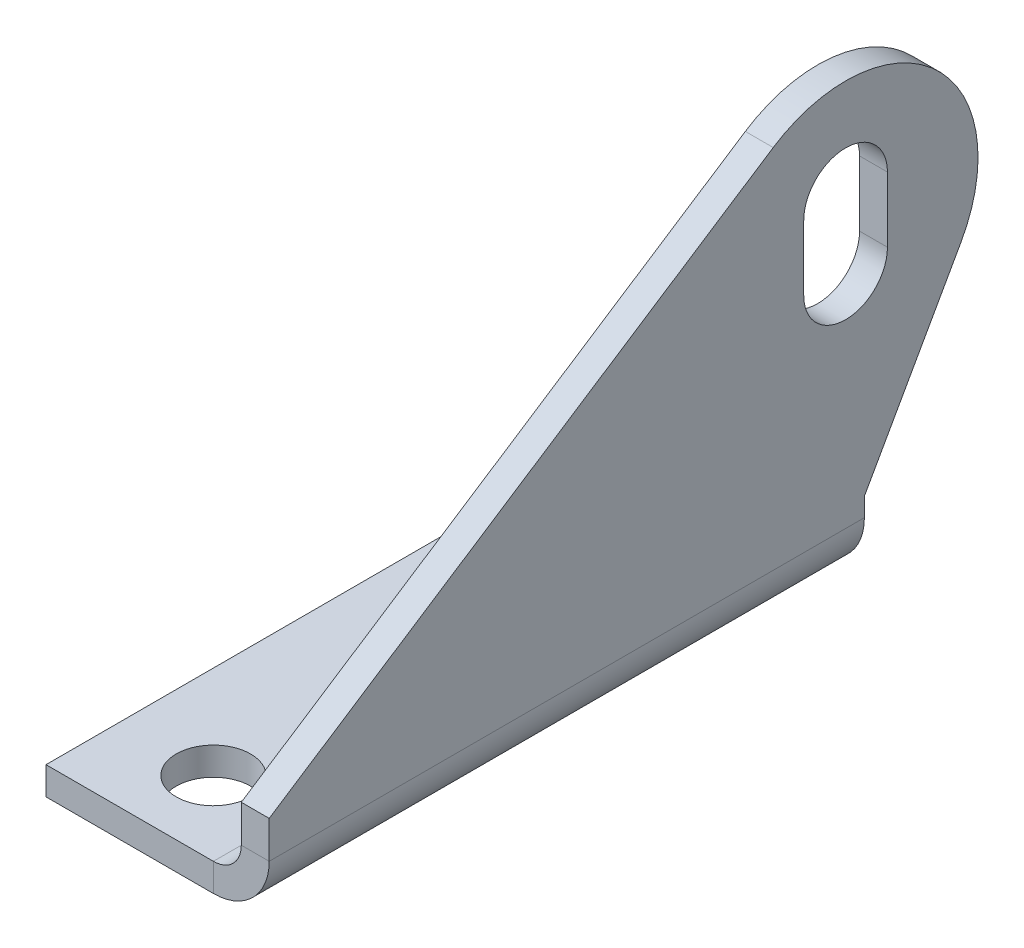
ISO-10303-21;
HEADER;
FILE_DESCRIPTION(('STEP AP214'),'2;1');
FILE_NAME('part.step','',(''),(''),'','','');
FILE_SCHEMA(('AUTOMOTIVE_DESIGN { 1 0 10303 214 1 1 1 1 }'));
ENDSEC;
DATA;
#1=APPLICATION_CONTEXT('core data for automotive mechanical design processes');
#2=APPLICATION_PROTOCOL_DEFINITION('international standard','automotive_design',2000,#1);
#3=PRODUCT_CONTEXT('',#1,'mechanical');
#4=PRODUCT('Part','Part','',(#3));
#5=PRODUCT_RELATED_PRODUCT_CATEGORY('part','',(#4));
#6=PRODUCT_DEFINITION_FORMATION('','',#4);
#7=PRODUCT_DEFINITION_CONTEXT('part definition',#1,'design');
#8=PRODUCT_DEFINITION('design','',#6,#7);
#9=PRODUCT_DEFINITION_SHAPE('','',#8);
#10=(LENGTH_UNIT() NAMED_UNIT(*) SI_UNIT(.MILLI.,.METRE.));
#11=(NAMED_UNIT(*) PLANE_ANGLE_UNIT() SI_UNIT($,.RADIAN.));
#12=(NAMED_UNIT(*) SI_UNIT($,.STERADIAN.) SOLID_ANGLE_UNIT());
#13=UNCERTAINTY_MEASURE_WITH_UNIT(LENGTH_MEASURE(1.E-05),#10,'distance_accuracy_value','');
#14=(GEOMETRIC_REPRESENTATION_CONTEXT(3) GLOBAL_UNCERTAINTY_ASSIGNED_CONTEXT((#13)) GLOBAL_UNIT_ASSIGNED_CONTEXT((#10,
#11,#12)) REPRESENTATION_CONTEXT('',''));
#15=CARTESIAN_POINT('',(0.,0.,0.));
#16=DIRECTION('',(0.,0.,1.));
#17=DIRECTION('',(1.,0.,0.));
#18=AXIS2_PLACEMENT_3D('',#15,#16,#17);
#19=CARTESIAN_POINT('',(-22.225,0.,-12.7));
#20=DIRECTION('',(0.,1.,0.));
#21=DIRECTION('',(-1.,0.,0.));
#22=AXIS2_PLACEMENT_3D('',#19,#20,#21);
#23=CYLINDRICAL_SURFACE('',#22,6.35);
#24=CARTESIAN_POINT('',(-22.225,0.,-12.7));
#25=DIRECTION('',(0.,1.,0.));
#26=DIRECTION('',(-1.,0.,0.));
#27=AXIS2_PLACEMENT_3D('',#24,#25,#26);
#28=CIRCLE('',#27,6.35);
#29=CARTESIAN_POINT('',(-28.575,0.,-12.7));
#30=VERTEX_POINT('',#29);
#31=EDGE_CURVE('E281',#30,#30,#28,.T.);
#32=ORIENTED_EDGE('',*,*,#31,.F.);
#33=EDGE_LOOP('',(#32));
#34=FACE_BOUND('',#33,.T.);
#35=CARTESIAN_POINT('',(-22.225,4.7625,-12.7));
#36=DIRECTION('',(0.,1.,0.));
#37=DIRECTION('',(-1.,0.,0.));
#38=AXIS2_PLACEMENT_3D('',#35,#36,#37);
#39=CIRCLE('',#38,6.35);
#40=CARTESIAN_POINT('',(-28.575,4.7625,-12.7));
#41=VERTEX_POINT('',#40);
#42=EDGE_CURVE('E172',#41,#41,#39,.T.);
#43=ORIENTED_EDGE('',*,*,#42,.T.);
#44=EDGE_LOOP('',(#43));
#45=FACE_BOUND('',#44,.T.);
#46=ADVANCED_FACE('F31',(#34,#45),#23,.F.);
#47=CARTESIAN_POINT('',(0.,0.,-101.6));
#48=DIRECTION('',(0.,-1.,0.));
#49=DIRECTION('',(1.,0.,0.));
#50=AXIS2_PLACEMENT_3D('',#47,#48,#49);
#51=PLANE('',#50);
#52=DIRECTION('',(0.,0.,-1.));
#53=VECTOR('',#52,1.);
#54=CARTESIAN_POINT('',(-9.525,0.,-101.6));
#55=LINE('',#54,#53);
#56=CARTESIAN_POINT('',(-9.525,0.,0.));
#57=VERTEX_POINT('',#56);
#58=CARTESIAN_POINT('',(-9.52499999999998,0.,-101.6));
#59=VERTEX_POINT('',#58);
#60=EDGE_CURVE('E292',#57,#59,#55,.T.);
#61=ORIENTED_EDGE('',*,*,#60,.F.);
#62=DIRECTION('',(1.,0.,0.));
#63=VECTOR('',#62,1.);
#64=CARTESIAN_POINT('',(0.,0.,0.));
#65=LINE('',#64,#63);
#66=CARTESIAN_POINT('',(-38.1,0.,0.));
#67=VERTEX_POINT('',#66);
#68=EDGE_CURVE('E284',#67,#57,#65,.T.);
#69=ORIENTED_EDGE('',*,*,#68,.F.);
#70=DIRECTION('',(0.,0.,1.));
#71=VECTOR('',#70,1.);
#72=CARTESIAN_POINT('',(-38.1,0.,-101.6));
#73=LINE('',#72,#71);
#74=CARTESIAN_POINT('',(-38.1,0.,-101.6));
#75=VERTEX_POINT('',#74);
#76=EDGE_CURVE('E286',#75,#67,#73,.T.);
#77=ORIENTED_EDGE('',*,*,#76,.F.);
#78=DIRECTION('',(1.,0.,0.));
#79=VECTOR('',#78,1.);
#80=CARTESIAN_POINT('',(0.,0.,-101.6));
#81=LINE('',#80,#79);
#82=EDGE_CURVE('E45',#75,#59,#81,.T.);
#83=ORIENTED_EDGE('',*,*,#82,.T.);
#84=EDGE_LOOP('',(#61,#69,#77,#83));
#85=FACE_BOUND('',#84,.T.);
#86=CARTESIAN_POINT('',(-22.225,0.,-88.9));
#87=DIRECTION('',(0.,1.,0.));
#88=DIRECTION('',(-1.,0.,0.));
#89=AXIS2_PLACEMENT_3D('',#86,#87,#88);
#90=CIRCLE('',#89,6.35);
#91=CARTESIAN_POINT('',(-28.575,0.,-88.9));
#92=VERTEX_POINT('',#91);
#93=EDGE_CURVE('E278',#92,#92,#90,.T.);
#94=ORIENTED_EDGE('',*,*,#93,.T.);
#95=EDGE_LOOP('',(#94));
#96=FACE_BOUND('',#95,.T.);
#97=ORIENTED_EDGE('',*,*,#31,.T.);
#98=EDGE_LOOP('',(#97));
#99=FACE_BOUND('',#98,.T.);
#100=ADVANCED_FACE('F306',(#85,#96,#99),#51,.T.);
#101=CARTESIAN_POINT('',(-22.225,0.,-88.9));
#102=DIRECTION('',(0.,1.,0.));
#103=DIRECTION('',(-1.,0.,0.));
#104=AXIS2_PLACEMENT_3D('',#101,#102,#103);
#105=CYLINDRICAL_SURFACE('',#104,6.35);
#106=ORIENTED_EDGE('',*,*,#93,.F.);
#107=EDGE_LOOP('',(#106));
#108=FACE_BOUND('',#107,.T.);
#109=CARTESIAN_POINT('',(-22.225,4.7625,-88.9));
#110=DIRECTION('',(0.,1.,0.));
#111=DIRECTION('',(-1.,0.,0.));
#112=AXIS2_PLACEMENT_3D('',#109,#110,#111);
#113=CIRCLE('',#112,6.35);
#114=CARTESIAN_POINT('',(-28.575,4.7625,-88.9));
#115=VERTEX_POINT('',#114);
#116=EDGE_CURVE('E168',#115,#115,#113,.T.);
#117=ORIENTED_EDGE('',*,*,#116,.T.);
#118=EDGE_LOOP('',(#117));
#119=FACE_BOUND('',#118,.T.);
#120=ADVANCED_FACE('F346',(#108,#119),#105,.F.);
#121=CARTESIAN_POINT('',(0.,4.7625,-101.6));
#122=DIRECTION('',(0.,-1.,0.));
#123=DIRECTION('',(1.,0.,0.));
#124=AXIS2_PLACEMENT_3D('',#121,#122,#123);
#125=PLANE('',#124);
#126=ORIENTED_EDGE('',*,*,#116,.F.);
#127=EDGE_LOOP('',(#126));
#128=FACE_BOUND('',#127,.T.);
#129=ORIENTED_EDGE('',*,*,#42,.F.);
#130=EDGE_LOOP('',(#129));
#131=FACE_BOUND('',#130,.T.);
#132=DIRECTION('',(1.,0.,0.));
#133=VECTOR('',#132,1.);
#134=CARTESIAN_POINT('',(0.,4.7625,0.));
#135=LINE('',#134,#133);
#136=CARTESIAN_POINT('',(-38.1,4.7625,0.));
#137=VERTEX_POINT('',#136);
#138=CARTESIAN_POINT('',(-9.525,4.7625,0.));
#139=VERTEX_POINT('',#138);
#140=EDGE_CURVE('E272',#137,#139,#135,.T.);
#141=ORIENTED_EDGE('',*,*,#140,.T.);
#142=DIRECTION('',(0.,0.,-1.));
#143=VECTOR('',#142,1.);
#144=CARTESIAN_POINT('',(-9.525,4.7625,-101.6));
#145=LINE('',#144,#143);
#146=CARTESIAN_POINT('',(-9.52499999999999,4.7625,-101.6));
#147=VERTEX_POINT('',#146);
#148=EDGE_CURVE('E290',#139,#147,#145,.T.);
#149=ORIENTED_EDGE('',*,*,#148,.T.);
#150=DIRECTION('',(1.,0.,0.));
#151=VECTOR('',#150,1.);
#152=CARTESIAN_POINT('',(0.,4.7625,-101.6));
#153=LINE('',#152,#151);
#154=CARTESIAN_POINT('',(-38.1,4.7625,-101.6));
#155=VERTEX_POINT('',#154);
#156=EDGE_CURVE('E274',#155,#147,#153,.T.);
#157=ORIENTED_EDGE('',*,*,#156,.F.);
#158=DIRECTION('',(0.,0.,1.));
#159=VECTOR('',#158,1.);
#160=CARTESIAN_POINT('',(-38.1,4.7625,-101.6));
#161=LINE('',#160,#159);
#162=EDGE_CURVE('E53',#155,#137,#161,.T.);
#163=ORIENTED_EDGE('',*,*,#162,.T.);
#164=EDGE_LOOP('',(#141,#149,#157,#163));
#165=FACE_BOUND('',#164,.T.);
#166=ADVANCED_FACE('F311',(#128,#131,#165),#125,.F.);
#167=CARTESIAN_POINT('',(0.,215.846280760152,-101.6));
#168=DIRECTION('',(0.,0.,-1.));
#169=DIRECTION('',(0.,1.,0.));
#170=AXIS2_PLACEMENT_3D('',#167,#168,#169);
#171=PLANE('',#170);
#172=DIRECTION('',(0.,-1.,0.));
#173=VECTOR('',#172,1.);
#174=CARTESIAN_POINT('',(-9.52500000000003,215.846280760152,-101.6));
#175=LINE('',#174,#173);
#176=EDGE_CURVE('E11',#147,#59,#175,.T.);
#177=ORIENTED_EDGE('',*,*,#176,.T.);
#178=ORIENTED_EDGE('',*,*,#82,.F.);
#179=DIRECTION('',(0.,-1.,0.));
#180=VECTOR('',#179,1.);
#181=CARTESIAN_POINT('',(-38.1,215.846280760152,-101.6));
#182=LINE('',#181,#180);
#183=EDGE_CURVE('E39',#155,#75,#182,.T.);
#184=ORIENTED_EDGE('',*,*,#183,.F.);
#185=ORIENTED_EDGE('',*,*,#156,.T.);
#186=EDGE_LOOP('',(#177,#178,#184,#185));
#187=FACE_BOUND('',#186,.T.);
#188=ADVANCED_FACE('F33',(#187),#171,.T.);
#189=CARTESIAN_POINT('',(-38.1,215.846280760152,-101.6));
#190=DIRECTION('',(1.,0.,0.));
#191=DIRECTION('',(0.,1.,0.));
#192=AXIS2_PLACEMENT_3D('',#189,#190,#191);
#193=PLANE('',#192);
#194=ORIENTED_EDGE('',*,*,#76,.T.);
#195=DIRECTION('',(0.,-1.,0.));
#196=VECTOR('',#195,1.);
#197=CARTESIAN_POINT('',(-38.1,215.846280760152,0.));
#198=LINE('',#197,#196);
#199=EDGE_CURVE('E298',#137,#67,#198,.T.);
#200=ORIENTED_EDGE('',*,*,#199,.F.);
#201=ORIENTED_EDGE('',*,*,#162,.F.);
#202=ORIENTED_EDGE('',*,*,#183,.T.);
#203=EDGE_LOOP('',(#194,#200,#201,#202));
#204=FACE_BOUND('',#203,.T.);
#205=ADVANCED_FACE('F301',(#204),#193,.F.);
#206=CARTESIAN_POINT('',(0.,215.846280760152,0.));
#207=DIRECTION('',(0.,0.,-1.));
#208=DIRECTION('',(0.,1.,0.));
#209=AXIS2_PLACEMENT_3D('',#206,#207,#208);
#210=PLANE('',#209);
#211=ORIENTED_EDGE('',*,*,#68,.T.);
#212=DIRECTION('',(0.,-1.,0.));
#213=VECTOR('',#212,1.);
#214=CARTESIAN_POINT('',(-9.52500000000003,215.846280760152,0.));
#215=LINE('',#214,#213);
#216=EDGE_CURVE('E295',#139,#57,#215,.T.);
#217=ORIENTED_EDGE('',*,*,#216,.F.);
#218=ORIENTED_EDGE('',*,*,#140,.F.);
#219=ORIENTED_EDGE('',*,*,#199,.T.);
#220=EDGE_LOOP('',(#211,#217,#218,#219));
#221=FACE_BOUND('',#220,.T.);
#222=ADVANCED_FACE('F310',(#221),#210,.F.);
#223=CARTESIAN_POINT('',(-280.587875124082,42.0091825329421,-118.093172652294));
#224=DIRECTION('',(0.,-0.490413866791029,-0.871489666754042));
#225=DIRECTION('',(0.,0.871489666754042,-0.490413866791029));
#226=AXIS2_PLACEMENT_3D('',#223,#224,#225);
#227=PLANE('',#226);
#228=DIRECTION('',(1.,0.,0.));
#229=VECTOR('',#228,1.);
#230=CARTESIAN_POINT('',(-280.587875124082,42.0091825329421,-118.093172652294));
#231=LINE('',#230,#229);
#232=CARTESIAN_POINT('',(-4.7625,42.0091825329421,-118.093172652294));
#233=VERTEX_POINT('',#232);
#234=CARTESIAN_POINT('',(0.,42.0091825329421,-118.093172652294));
#235=VERTEX_POINT('',#234);
#236=EDGE_CURVE('E163',#233,#235,#231,.T.);
#237=ORIENTED_EDGE('',*,*,#236,.T.);
#238=DIRECTION('',(0.,-0.871489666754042,0.490413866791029));
#239=VECTOR('',#238,1.);
#240=CARTESIAN_POINT('',(0.,3.0544231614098,-96.1721391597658));
#241=LINE('',#240,#239);
#242=CARTESIAN_POINT('',(0.,12.7,-101.6));
#243=VERTEX_POINT('',#242);
#244=EDGE_CURVE('E261',#235,#243,#241,.T.);
#245=ORIENTED_EDGE('',*,*,#244,.T.);
#246=DIRECTION('',(1.,0.,0.));
#247=VECTOR('',#246,1.);
#248=CARTESIAN_POINT('',(-280.587875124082,12.7,-101.6));
#249=LINE('',#248,#247);
#250=CARTESIAN_POINT('',(-4.7625,12.7,-101.6));
#251=VERTEX_POINT('',#250);
#252=EDGE_CURVE('E169',#251,#243,#249,.T.);
#253=ORIENTED_EDGE('',*,*,#252,.F.);
#254=DIRECTION('',(0.,0.871489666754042,-0.490413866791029));
#255=VECTOR('',#254,1.);
#256=CARTESIAN_POINT('',(-4.7625,42.0091825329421,-118.093172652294));
#257=LINE('',#256,#255);
#258=EDGE_CURVE('E167',#251,#233,#257,.T.);
#259=ORIENTED_EDGE('',*,*,#258,.T.);
#260=EDGE_LOOP('',(#237,#245,#253,#259));
#261=FACE_BOUND('',#260,.T.);
#262=ADVANCED_FACE('F332',(#261),#227,.T.);
#263=CARTESIAN_POINT('',(-280.587875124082,53.0954784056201,-98.3922772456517));
#264=DIRECTION('',(1.,0.,0.));
#265=DIRECTION('',(0.,0.,-1.));
#266=AXIS2_PLACEMENT_3D('',#263,#264,#265);
#267=CYLINDRICAL_SURFACE('',#266,22.606);
#268=DIRECTION('',(1.,0.,0.));
#269=VECTOR('',#268,1.);
#270=CARTESIAN_POINT('',(-280.587875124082,72.0264477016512,-86.0371310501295));
#271=LINE('',#270,#269);
#272=CARTESIAN_POINT('',(-4.7625,72.0264477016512,-86.0371310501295));
#273=VERTEX_POINT('',#272);
#274=CARTESIAN_POINT('',(0.,72.0264477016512,-86.0371310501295));
#275=VERTEX_POINT('',#274);
#276=EDGE_CURVE('E257',#273,#275,#271,.T.);
#277=ORIENTED_EDGE('',*,*,#276,.T.);
#278=CARTESIAN_POINT('',(0.,53.0954784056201,-98.3922772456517));
#279=DIRECTION('',(1.,0.,0.));
#280=DIRECTION('',(0.,0.,-1.));
#281=AXIS2_PLACEMENT_3D('',#278,#279,#280);
#282=CIRCLE('',#281,22.606);
#283=EDGE_CURVE('E254',#275,#235,#282,.F.);
#284=ORIENTED_EDGE('',*,*,#283,.T.);
#285=ORIENTED_EDGE('',*,*,#236,.F.);
#286=CARTESIAN_POINT('',(-4.7625,53.0954784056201,-98.3922772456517));
#287=DIRECTION('',(1.,0.,0.));
#288=DIRECTION('',(0.,0.,1.));
#289=AXIS2_PLACEMENT_3D('',#286,#287,#288);
#290=CIRCLE('',#289,22.606);
#291=EDGE_CURVE('E252',#233,#273,#290,.T.);
#292=ORIENTED_EDGE('',*,*,#291,.T.);
#293=EDGE_LOOP('',(#277,#284,#285,#292));
#294=FACE_BOUND('',#293,.T.);
#295=ADVANCED_FACE('F329',(#294),#267,.T.);
#296=CARTESIAN_POINT('',(-280.587875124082,15.875,0.));
#297=DIRECTION('',(0.,0.837431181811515,0.546542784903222));
#298=DIRECTION('',(0.,-0.546542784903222,0.837431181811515));
#299=AXIS2_PLACEMENT_3D('',#296,#297,#298);
#300=PLANE('',#299);
#301=DIRECTION('',(1.,0.,0.));
#302=VECTOR('',#301,1.);
#303=CARTESIAN_POINT('',(-280.587875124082,15.875,0.));
#304=LINE('',#303,#302);
#305=CARTESIAN_POINT('',(-4.7625,15.875,0.));
#306=VERTEX_POINT('',#305);
#307=CARTESIAN_POINT('',(0.,15.875,0.));
#308=VERTEX_POINT('',#307);
#309=EDGE_CURVE('E249',#306,#308,#304,.T.);
#310=ORIENTED_EDGE('',*,*,#309,.T.);
#311=DIRECTION('',(0.,0.546542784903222,-0.837431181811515));
#312=VECTOR('',#311,1.);
#313=CARTESIAN_POINT('',(0.,57.6344985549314,-63.9853039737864));
#314=LINE('',#313,#312);
#315=EDGE_CURVE('E246',#308,#275,#314,.T.);
#316=ORIENTED_EDGE('',*,*,#315,.T.);
#317=ORIENTED_EDGE('',*,*,#276,.F.);
#318=DIRECTION('',(0.,-0.546542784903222,0.837431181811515));
#319=VECTOR('',#318,1.);
#320=CARTESIAN_POINT('',(-4.7625,15.875,0.));
#321=LINE('',#320,#319);
#322=EDGE_CURVE('E242',#273,#306,#321,.T.);
#323=ORIENTED_EDGE('',*,*,#322,.T.);
#324=EDGE_LOOP('',(#310,#316,#317,#323));
#325=FACE_BOUND('',#324,.T.);
#326=ADVANCED_FACE('F327',(#325),#300,.T.);
#327=CARTESIAN_POINT('',(4.99999999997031E-05,58.6517284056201,-98.3922772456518));
#328=DIRECTION('',(-1.,0.,0.));
#329=DIRECTION('',(0.,0.,1.));
#330=AXIS2_PLACEMENT_3D('',#327,#328,#329);
#331=CYLINDRICAL_SURFACE('',#330,7.14375);
#332=CARTESIAN_POINT('',(0.,58.6517284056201,-98.3922772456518));
#333=DIRECTION('',(1.,0.,0.));
#334=DIRECTION('',(0.,0.,-1.));
#335=AXIS2_PLACEMENT_3D('',#332,#333,#334);
#336=CIRCLE('',#335,7.14375);
#337=CARTESIAN_POINT('',(2.5E-06,58.6517284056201,-105.536027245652));
#338=VERTEX_POINT('',#337);
#339=CARTESIAN_POINT('',(2.5E-06,58.6517284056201,-91.2485272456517));
#340=VERTEX_POINT('',#339);
#341=EDGE_CURVE('E237',#338,#340,#336,.T.);
#342=ORIENTED_EDGE('',*,*,#341,.T.);
#343=DIRECTION('',(-1.,0.,0.));
#344=VECTOR('',#343,1.);
#345=CARTESIAN_POINT('',(4.99999999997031E-05,58.6517284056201,-91.2485272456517));
#346=LINE('',#345,#344);
#347=CARTESIAN_POINT('',(-4.7625,58.6517284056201,-91.2485272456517));
#348=VERTEX_POINT('',#347);
#349=EDGE_CURVE('E234',#340,#348,#346,.T.);
#350=ORIENTED_EDGE('',*,*,#349,.T.);
#351=CARTESIAN_POINT('',(-4.7625,58.6517284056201,-98.3922772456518));
#352=DIRECTION('',(-1.,0.,0.));
#353=DIRECTION('',(0.,0.,-1.));
#354=AXIS2_PLACEMENT_3D('',#351,#352,#353);
#355=CIRCLE('',#354,7.14375);
#356=CARTESIAN_POINT('',(-4.7625,58.6517284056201,-105.536027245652));
#357=VERTEX_POINT('',#356);
#358=EDGE_CURVE('E229',#348,#357,#355,.T.);
#359=ORIENTED_EDGE('',*,*,#358,.T.);
#360=DIRECTION('',(-1.,0.,0.));
#361=VECTOR('',#360,1.);
#362=CARTESIAN_POINT('',(4.99999999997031E-05,58.6517284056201,-105.536027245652));
#363=LINE('',#362,#361);
#364=EDGE_CURVE('E221',#338,#357,#363,.T.);
#365=ORIENTED_EDGE('',*,*,#364,.F.);
#366=EDGE_LOOP('',(#342,#350,#359,#365));
#367=FACE_BOUND('',#366,.T.);
#368=ADVANCED_FACE('F391',(#367),#331,.F.);
#369=CARTESIAN_POINT('',(4.99999999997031E-05,47.5392284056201,-105.536027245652));
#370=DIRECTION('',(0.,0.,-1.));
#371=DIRECTION('',(-1.,0.,0.));
#372=AXIS2_PLACEMENT_3D('',#369,#370,#371);
#373=PLANE('',#372);
#374=DIRECTION('',(0.,1.,0.));
#375=VECTOR('',#374,1.);
#376=CARTESIAN_POINT('',(0.,0.,-105.536027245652));
#377=LINE('',#376,#375);
#378=CARTESIAN_POINT('',(2.5E-06,47.5392284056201,-105.536027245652));
#379=VERTEX_POINT('',#378);
#380=EDGE_CURVE('E224',#379,#338,#377,.T.);
#381=ORIENTED_EDGE('',*,*,#380,.T.);
#382=ORIENTED_EDGE('',*,*,#364,.T.);
#383=DIRECTION('',(0.,-1.,0.));
#384=VECTOR('',#383,1.);
#385=CARTESIAN_POINT('',(-4.7625,47.5392284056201,-105.536027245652));
#386=LINE('',#385,#384);
#387=CARTESIAN_POINT('',(-4.7625,47.5392284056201,-105.536027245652));
#388=VERTEX_POINT('',#387);
#389=EDGE_CURVE('E216',#357,#388,#386,.T.);
#390=ORIENTED_EDGE('',*,*,#389,.T.);
#391=DIRECTION('',(-1.,0.,0.));
#392=VECTOR('',#391,1.);
#393=CARTESIAN_POINT('',(4.99999999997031E-05,47.5392284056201,-105.536027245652));
#394=LINE('',#393,#392);
#395=EDGE_CURVE('E209',#379,#388,#394,.T.);
#396=ORIENTED_EDGE('',*,*,#395,.F.);
#397=EDGE_LOOP('',(#381,#382,#390,#396));
#398=FACE_BOUND('',#397,.T.);
#399=ADVANCED_FACE('F398',(#398),#373,.F.);
#400=CARTESIAN_POINT('',(4.99999999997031E-05,47.5392284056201,-98.3922772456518));
#401=DIRECTION('',(-1.,0.,0.));
#402=DIRECTION('',(0.,0.,1.));
#403=AXIS2_PLACEMENT_3D('',#400,#401,#402);
#404=CYLINDRICAL_SURFACE('',#403,7.14375);
#405=CARTESIAN_POINT('',(0.,47.5392284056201,-98.3922772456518));
#406=DIRECTION('',(1.,0.,0.));
#407=DIRECTION('',(0.,0.,-1.));
#408=AXIS2_PLACEMENT_3D('',#405,#406,#407);
#409=CIRCLE('',#408,7.14375);
#410=CARTESIAN_POINT('',(2.5E-06,47.5392284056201,-91.2485272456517));
#411=VERTEX_POINT('',#410);
#412=EDGE_CURVE('E212',#411,#379,#409,.T.);
#413=ORIENTED_EDGE('',*,*,#412,.T.);
#414=ORIENTED_EDGE('',*,*,#395,.T.);
#415=CARTESIAN_POINT('',(-4.7625,47.5392284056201,-98.3922772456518));
#416=DIRECTION('',(-1.,0.,0.));
#417=DIRECTION('',(0.,0.,-1.));
#418=AXIS2_PLACEMENT_3D('',#415,#416,#417);
#419=CIRCLE('',#418,7.14375);
#420=CARTESIAN_POINT('',(-4.7625,47.5392284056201,-91.2485272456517));
#421=VERTEX_POINT('',#420);
#422=EDGE_CURVE('E204',#388,#421,#419,.T.);
#423=ORIENTED_EDGE('',*,*,#422,.T.);
#424=DIRECTION('',(-1.,0.,0.));
#425=VECTOR('',#424,1.);
#426=CARTESIAN_POINT('',(4.99999999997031E-05,47.5392284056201,-91.2485272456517));
#427=LINE('',#426,#425);
#428=EDGE_CURVE('E197',#411,#421,#427,.T.);
#429=ORIENTED_EDGE('',*,*,#428,.F.);
#430=EDGE_LOOP('',(#413,#414,#423,#429));
#431=FACE_BOUND('',#430,.T.);
#432=ADVANCED_FACE('F406',(#431),#404,.F.);
#433=CARTESIAN_POINT('',(4.99999999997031E-05,47.5392284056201,-91.2485272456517));
#434=DIRECTION('',(0.,0.,1.));
#435=DIRECTION('',(1.,0.,0.));
#436=AXIS2_PLACEMENT_3D('',#433,#434,#435);
#437=PLANE('',#436);
#438=DIRECTION('',(0.,-1.,0.));
#439=VECTOR('',#438,1.);
#440=CARTESIAN_POINT('',(0.,0.,-91.2485272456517));
#441=LINE('',#440,#439);
#442=EDGE_CURVE('E200',#340,#411,#441,.T.);
#443=ORIENTED_EDGE('',*,*,#442,.T.);
#444=ORIENTED_EDGE('',*,*,#428,.T.);
#445=DIRECTION('',(0.,1.,0.));
#446=VECTOR('',#445,1.);
#447=CARTESIAN_POINT('',(-4.7625,47.5392284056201,-91.2485272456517));
#448=LINE('',#447,#446);
#449=EDGE_CURVE('E195',#421,#348,#448,.T.);
#450=ORIENTED_EDGE('',*,*,#449,.T.);
#451=ORIENTED_EDGE('',*,*,#349,.F.);
#452=EDGE_LOOP('',(#443,#444,#450,#451));
#453=FACE_BOUND('',#452,.T.);
#454=ADVANCED_FACE('F414',(#453),#437,.F.);
#455=CARTESIAN_POINT('',(-4.7625,0.,-101.6));
#456=DIRECTION('',(1.,0.,0.));
#457=DIRECTION('',(0.,0.,-1.));
#458=AXIS2_PLACEMENT_3D('',#455,#456,#457);
#459=PLANE('',#458);
#460=ORIENTED_EDGE('',*,*,#449,.F.);
#461=ORIENTED_EDGE('',*,*,#422,.F.);
#462=ORIENTED_EDGE('',*,*,#389,.F.);
#463=ORIENTED_EDGE('',*,*,#358,.F.);
#464=EDGE_LOOP('',(#460,#461,#462,#463));
#465=FACE_BOUND('',#464,.T.);
#466=DIRECTION('',(0.,0.,-1.));
#467=VECTOR('',#466,1.);
#468=CARTESIAN_POINT('',(-4.7625,9.525,-101.6));
#469=LINE('',#468,#467);
#470=CARTESIAN_POINT('',(-4.7625,9.525,0.));
#471=VERTEX_POINT('',#470);
#472=CARTESIAN_POINT('',(-4.7625,9.525,-101.6));
#473=VERTEX_POINT('',#472);
#474=EDGE_CURVE('E145',#471,#473,#469,.T.);
#475=ORIENTED_EDGE('',*,*,#474,.F.);
#476=DIRECTION('',(0.,1.,0.));
#477=VECTOR('',#476,1.);
#478=CARTESIAN_POINT('',(-4.7625,0.,0.));
#479=LINE('',#478,#477);
#480=EDGE_CURVE('E193',#471,#306,#479,.T.);
#481=ORIENTED_EDGE('',*,*,#480,.T.);
#482=ORIENTED_EDGE('',*,*,#322,.F.);
#483=ORIENTED_EDGE('',*,*,#291,.F.);
#484=ORIENTED_EDGE('',*,*,#258,.F.);
#485=DIRECTION('',(0.,1.,0.));
#486=VECTOR('',#485,1.);
#487=CARTESIAN_POINT('',(-4.7625,0.,-101.6));
#488=LINE('',#487,#486);
#489=EDGE_CURVE('E159',#473,#251,#488,.T.);
#490=ORIENTED_EDGE('',*,*,#489,.F.);
#491=EDGE_LOOP('',(#475,#481,#482,#483,#484,#490));
#492=FACE_BOUND('',#491,.T.);
#493=ADVANCED_FACE('F165',(#465,#492),#459,.F.);
#494=CARTESIAN_POINT('',(-280.587875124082,0.,0.));
#495=DIRECTION('',(0.,0.,-1.));
#496=DIRECTION('',(-1.,0.,0.));
#497=AXIS2_PLACEMENT_3D('',#494,#495,#496);
#498=PLANE('',#497);
#499=DIRECTION('',(0.,1.,0.));
#500=VECTOR('',#499,1.);
#501=CARTESIAN_POINT('',(0.,0.,0.));
#502=LINE('',#501,#500);
#503=CARTESIAN_POINT('',(0.,9.525,0.));
#504=VERTEX_POINT('',#503);
#505=EDGE_CURVE('E190',#504,#308,#502,.T.);
#506=ORIENTED_EDGE('',*,*,#505,.T.);
#507=ORIENTED_EDGE('',*,*,#309,.F.);
#508=ORIENTED_EDGE('',*,*,#480,.F.);
#509=DIRECTION('',(1.,0.,0.));
#510=VECTOR('',#509,1.);
#511=CARTESIAN_POINT('',(-280.587875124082,9.525,0.));
#512=LINE('',#511,#510);
#513=EDGE_CURVE('E187',#471,#504,#512,.T.);
#514=ORIENTED_EDGE('',*,*,#513,.T.);
#515=EDGE_LOOP('',(#506,#507,#508,#514));
#516=FACE_BOUND('',#515,.T.);
#517=ADVANCED_FACE('F322',(#516),#498,.F.);
#518=CARTESIAN_POINT('',(0.,0.,-101.6));
#519=DIRECTION('',(1.,0.,0.));
#520=DIRECTION('',(0.,0.,-1.));
#521=AXIS2_PLACEMENT_3D('',#518,#519,#520);
#522=PLANE('',#521);
#523=ORIENTED_EDGE('',*,*,#412,.F.);
#524=ORIENTED_EDGE('',*,*,#442,.F.);
#525=ORIENTED_EDGE('',*,*,#341,.F.);
#526=ORIENTED_EDGE('',*,*,#380,.F.);
#527=EDGE_LOOP('',(#523,#524,#525,#526));
#528=FACE_BOUND('',#527,.T.);
#529=ORIENTED_EDGE('',*,*,#505,.F.);
#530=DIRECTION('',(0.,0.,-1.));
#531=VECTOR('',#530,1.);
#532=CARTESIAN_POINT('',(0.,9.525,-101.6));
#533=LINE('',#532,#531);
#534=CARTESIAN_POINT('',(0.,9.525,-101.6));
#535=VERTEX_POINT('',#534);
#536=EDGE_CURVE('E183',#504,#535,#533,.T.);
#537=ORIENTED_EDGE('',*,*,#536,.T.);
#538=DIRECTION('',(0.,1.,0.));
#539=VECTOR('',#538,1.);
#540=CARTESIAN_POINT('',(0.,0.,-101.6));
#541=LINE('',#540,#539);
#542=EDGE_CURVE('E161',#535,#243,#541,.T.);
#543=ORIENTED_EDGE('',*,*,#542,.T.);
#544=ORIENTED_EDGE('',*,*,#244,.F.);
#545=ORIENTED_EDGE('',*,*,#283,.F.);
#546=ORIENTED_EDGE('',*,*,#315,.F.);
#547=EDGE_LOOP('',(#529,#537,#543,#544,#545,#546));
#548=FACE_BOUND('',#547,.T.);
#549=ADVANCED_FACE('F334',(#528,#548),#522,.T.);
#550=CARTESIAN_POINT('',(-280.587875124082,0.,-101.6));
#551=DIRECTION('',(0.,0.,-1.));
#552=DIRECTION('',(-1.,0.,0.));
#553=AXIS2_PLACEMENT_3D('',#550,#551,#552);
#554=PLANE('',#553);
#555=ORIENTED_EDGE('',*,*,#252,.T.);
#556=ORIENTED_EDGE('',*,*,#542,.F.);
#557=DIRECTION('',(1.,0.,0.));
#558=VECTOR('',#557,1.);
#559=CARTESIAN_POINT('',(-280.587875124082,9.525,-101.6));
#560=LINE('',#559,#558);
#561=EDGE_CURVE('E137',#473,#535,#560,.T.);
#562=ORIENTED_EDGE('',*,*,#561,.F.);
#563=ORIENTED_EDGE('',*,*,#489,.T.);
#564=EDGE_LOOP('',(#555,#556,#562,#563));
#565=FACE_BOUND('',#564,.T.);
#566=ADVANCED_FACE('F158',(#565),#554,.T.);
#567=CARTESIAN_POINT('',(-9.525,9.525,-101.6));
#568=DIRECTION('',(0.,0.,-1.));
#569=DIRECTION('',(-1.,0.,0.));
#570=AXIS2_PLACEMENT_3D('',#567,#568,#569);
#571=PLANE('',#570);
#572=ORIENTED_EDGE('',*,*,#176,.F.);
#573=CARTESIAN_POINT('',(-9.525,9.525,-101.6));
#574=DIRECTION('',(0.,0.,1.));
#575=DIRECTION('',(1.,0.,0.));
#576=AXIS2_PLACEMENT_3D('',#573,#574,#575);
#577=CIRCLE('',#576,4.7625);
#578=EDGE_CURVE('E132',#147,#473,#577,.T.);
#579=ORIENTED_EDGE('',*,*,#578,.T.);
#580=ORIENTED_EDGE('',*,*,#561,.T.);
#581=CARTESIAN_POINT('',(-9.525,9.525,-101.6));
#582=DIRECTION('',(0.,0.,1.));
#583=DIRECTION('',(1.,0.,0.));
#584=AXIS2_PLACEMENT_3D('',#581,#582,#583);
#585=CIRCLE('',#584,9.525);
#586=EDGE_CURVE('E315',#59,#535,#585,.T.);
#587=ORIENTED_EDGE('',*,*,#586,.F.);
#588=EDGE_LOOP('',(#572,#579,#580,#587));
#589=FACE_BOUND('',#588,.T.);
#590=ADVANCED_FACE('F134',(#589),#571,.T.);
#591=CARTESIAN_POINT('',(-9.525,9.525,0.));
#592=DIRECTION('',(0.,0.,1.));
#593=DIRECTION('',(1.,0.,0.));
#594=AXIS2_PLACEMENT_3D('',#591,#592,#593);
#595=PLANE('',#594);
#596=CARTESIAN_POINT('',(-9.525,9.525,0.));
#597=DIRECTION('',(0.,0.,1.));
#598=DIRECTION('',(1.,0.,0.));
#599=AXIS2_PLACEMENT_3D('',#596,#597,#598);
#600=CIRCLE('',#599,4.7625);
#601=EDGE_CURVE('E141',#471,#139,#600,.F.);
#602=ORIENTED_EDGE('',*,*,#601,.T.);
#603=ORIENTED_EDGE('',*,*,#216,.T.);
#604=CARTESIAN_POINT('',(-9.525,9.525,0.));
#605=DIRECTION('',(0.,0.,1.));
#606=DIRECTION('',(1.,0.,0.));
#607=AXIS2_PLACEMENT_3D('',#604,#605,#606);
#608=CIRCLE('',#607,9.525);
#609=EDGE_CURVE('E152',#504,#57,#608,.F.);
#610=ORIENTED_EDGE('',*,*,#609,.F.);
#611=ORIENTED_EDGE('',*,*,#513,.F.);
#612=EDGE_LOOP('',(#602,#603,#610,#611));
#613=FACE_BOUND('',#612,.T.);
#614=ADVANCED_FACE('F319',(#613),#595,.T.);
#615=CARTESIAN_POINT('',(-9.525,9.525,-262.256236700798));
#616=DIRECTION('',(0.,0.,1.));
#617=DIRECTION('',(1.,0.,0.));
#618=AXIS2_PLACEMENT_3D('',#615,#616,#617);
#619=CYLINDRICAL_SURFACE('',#618,9.525);
#620=ORIENTED_EDGE('',*,*,#536,.F.);
#621=ORIENTED_EDGE('',*,*,#609,.T.);
#622=ORIENTED_EDGE('',*,*,#60,.T.);
#623=ORIENTED_EDGE('',*,*,#586,.T.);
#624=EDGE_LOOP('',(#620,#621,#622,#623));
#625=FACE_BOUND('',#624,.T.);
#626=ADVANCED_FACE('F314',(#625),#619,.T.);
#627=CARTESIAN_POINT('',(-9.525,9.525,-262.256236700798));
#628=DIRECTION('',(0.,0.,1.));
#629=DIRECTION('',(1.,0.,0.));
#630=AXIS2_PLACEMENT_3D('',#627,#628,#629);
#631=CYLINDRICAL_SURFACE('',#630,4.7625);
#632=ORIENTED_EDGE('',*,*,#474,.T.);
#633=ORIENTED_EDGE('',*,*,#578,.F.);
#634=ORIENTED_EDGE('',*,*,#148,.F.);
#635=ORIENTED_EDGE('',*,*,#601,.F.);
#636=EDGE_LOOP('',(#632,#633,#634,#635));
#637=FACE_BOUND('',#636,.T.);
#638=ADVANCED_FACE('F146',(#637),#631,.F.);
#639=CLOSED_SHELL('',(#46,#100,#120,#166,#188,#205,#222,#262,#295,#326,#368,#399,#432,#454,#493,
#517,#549,#566,#590,#614,#626,#638));
#640=MANIFOLD_SOLID_BREP('B2',#639);
#641=ADVANCED_BREP_SHAPE_REPRESENTATION('',(#18,#640),#14);
#642=SHAPE_DEFINITION_REPRESENTATION(#9,#641);
ENDSEC;
END-ISO-10303-21;
